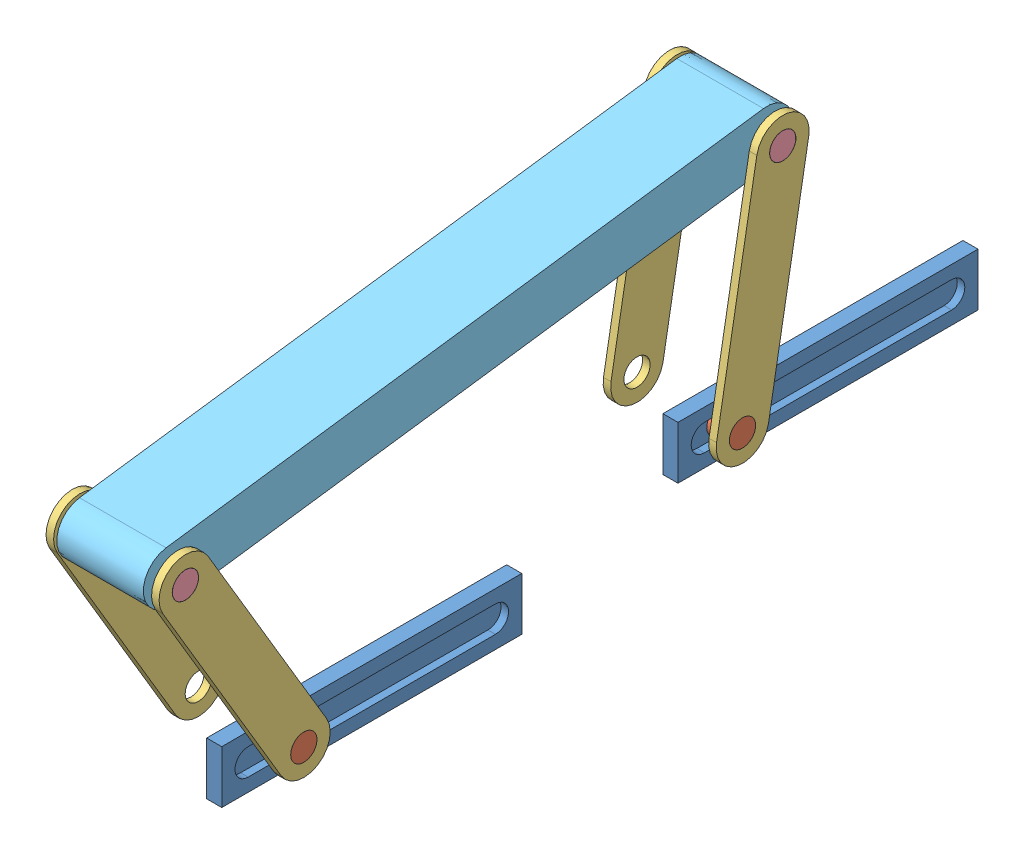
SolidWorks assembly EW - Convayer Assembly.SLDASM, configuration Default (file format 11000). Lengths in mm.
Overall size (150 461.83 1119.62).
11 component instances, 5 part files, 23 mates.
Components (placement in the parent):
- EW - Convayer Track (lower)-1: EW - Convayer Track (lower).SLDPRT [Default] at (74.9861 115.0955 407.3699) size (20 70 398.1)
- EW - Convayer Bolt (3.5 D x 3 L)-1: EW - Convayer Bolt (3.5 D x 3 L).SLDPRT [Default] at (114.9861 150.0955 318.4466) x (0 0.996066 0.088612) z (-1 0 0) size (35 35 30)
- EW - Convayer Arm (lower)-2: EW - Convayer Arm (lower).SLDPRT [Default] at (104.9861 414.9983 475.5788) x (1 0 0) z (0 0.860074 0.510169) size (10 70 378)
- EW - Convayer Shaft (3.5cm D x 15cm L)-1: EW - Convayer Shaft (3.5cm D x 15cm L).SLDPRT [Default] at (-35.0139 414.9983 475.5788) x (1 0 0) z (0 0.75541 -0.655253) size (150 35 35)
- EW - Convayer rep (11.5cm W x 80cm L - 3.5cm D)-1: EW - Convayer rep (11.5cm W x 80cm L - 3.5cm D).SLDPRT [Default] at (-20.8582 414.9983 475.5788) x (1 0 0) z (0 -0.135539 0.990772) size (115 70 870)
- EW - Convayer Arm (lower)-3: EW - Convayer Arm (lower).SLDPRT [Default] at (-35.0139 414.9983 475.5788) x (1 0 0) z (0 0.860074 0.510169) size (10 70 378)
- EW - Convayer Shaft (3.5cm D x 15cm L)-2: EW - Convayer Shaft (3.5cm D x 15cm L).SLDPRT [Default] at (-35.0139 523.4297 -317.0388) x (1 0 0) z (0 0.892337 0.451369) size (150 35 35)
- EW - Convayer Track (lower)-2: EW - Convayer Track (lower).SLDPRT [Default] at (74.9861 185.0955 -197.9819) size (20 70 398.1)
- EW - Convayer Arm (lower)-4: EW - Convayer Arm (lower).SLDPRT [Default] at (104.9861 523.4297 -317.0388) x (1 0 0) z (0 0.984851 -0.173402) size (10 70 378)
- EW - Convayer Arm (lower)-5: EW - Convayer Arm (lower).SLDPRT [Default] at (-35.0139 523.4297 -317.0388) x (1 0 0) z (0 0.984851 -0.173402) size (10 70 378)
- EW - Convayer Bolt (3.5 D x 3 L)-2: EW - Convayer Bolt (3.5 D x 3 L).SLDPRT [Default] at (114.9861 220.0955 -263.6309) x (0 -0.963954 -0.26607) z (-1 0 0) size (35 35 30)
Mates (geometry in assembly coordinates):
- Coincident1: coincident: plane of EW - Convayer Track (lower)-1 through (84.9861 150.0955 372.3699) normal (1 0 0); plane of EW - Convayer Bolt (3.5 D x 3 L)-1 through (84.9861 150.0955 318.4466) normal (-1 0 0)
- Tangent2: tangent: plane of EW - Convayer Track (lower)-1 through (84.9861 132.5955 372.3699) normal (0 1 0); cylinder of EW - Convayer Bolt (3.5 D x 3 L)-1 through (84.9861 150.0955 318.4466) axis (1 0 0) radius 17.5
- Concentric1: concentric: cylinder of EW - Convayer Bolt (3.5 D x 3 L)-1 through (84.9861 150.0955 318.4466) axis (1 0 0) radius 17.5; cylinder of EW - Convayer Arm (lower)-2 through (114.9861 150.0955 318.4466) axis (-1 0 0) radius 17.5
- Coincident2: coincident: plane of EW - Convayer Bolt (3.5 D x 3 L)-1 through (114.9861 150.0955 318.4466) normal (1 0 0); plane of EW - Convayer Arm (lower)-2 through (114.9861 150.0955 318.4466) normal (1 0 0)
- Concentric2: concentric: cylinder of EW - Convayer Arm (lower)-2 through (114.9861 414.9983 475.5788) axis (-1 0 0) radius 17.5; cylinder of EW - Convayer Shaft (3.5cm D x 15cm L)-1 through (114.9861 414.9983 475.5788) axis (-1 0 0) radius 17.5
- Coincident3: coincident: plane of EW - Convayer Arm (lower)-2 through (114.9861 150.0955 318.4466) normal (1 0 0); plane of EW - Convayer Shaft (3.5cm D x 15cm L)-1 through (114.9861 414.9983 475.5788) normal (1 0 0)
- Concentric3: concentric: cylinder of EW - Convayer Shaft (3.5cm D x 15cm L)-1 through (114.9861 414.9983 475.5788) axis (-1 0 0) radius 17.5; cylinder of EW - Convayer rep (11.5cm W x 80cm L - 3.5cm D)-1 through (94.1418 414.9983 475.5788) axis (-1 0 0) radius 17.5
- Concentric4: concentric: cylinder of EW - Convayer Shaft (3.5cm D x 15cm L)-1 through (114.9861 414.9983 475.5788) axis (-1 0 0) radius 17.5; cylinder of EW - Convayer Arm (lower)-3 through (-25.0139 414.9983 475.5788) axis (-1 0 0) radius 17.5
- Coincident4: coincident: plane of EW - Convayer Shaft (3.5cm D x 15cm L)-1 through (-35.0139 414.9983 475.5788) normal (-1 0 0); plane of EW - Convayer Arm (lower)-3 through (-35.0139 150.0955 318.4466) normal (-1 0 0)
- Concentric5: concentric: circle of EW - Convayer Arm (lower)-2; circle of EW - Convayer Arm (lower)-3
- Coincident5: coincident: cylinder of EW - Convayer rep (11.5cm W x 80cm L - 3.5cm D)-1 through (94.1418 523.4297 -317.0388) axis (-1 0 0) radius 17.5; circle of EW - Convayer Shaft (3.5cm D x 15cm L)-2
- Concentric6: concentric: cylinder of EW - Convayer Shaft (3.5cm D x 15cm L)-2 through (114.9861 523.4297 -317.0388) axis (-1 0 0) radius 17.5; cylinder of EW - Convayer Arm (lower)-4 through (114.9861 523.4297 -317.0388) axis (-1 0 0) radius 17.5
- Coincident10: coincident: plane of EW - Convayer Shaft (3.5cm D x 15cm L)-2 through (114.9861 523.4297 -317.0388) normal (1 0 0); plane of EW - Convayer Arm (lower)-4 through (114.9861 220.0955 -263.6309) normal (1 0 0)
- Coincident11: coincident: circle of EW - Convayer Arm (lower)-4; cylinder of EW - Convayer Bolt (3.5 D x 3 L)-2 through (84.9861 220.0955 -263.6309) axis (1 0 0) radius 17.5
- Coincident12: coincident: plane of EW - Convayer Arm (lower)-4 through (114.9861 220.0955 -263.6309) normal (1 0 0); plane of EW - Convayer Bolt (3.5 D x 3 L)-2 through (114.9861 220.0955 -263.6309) normal (1 0 0)
- Concentric7: concentric: cylinder of EW - Convayer Shaft (3.5cm D x 15cm L)-2 through (114.9861 523.4297 -317.0388) axis (-1 0 0) radius 17.5; cylinder of EW - Convayer Arm (lower)-5 through (-25.0139 523.4297 -317.0388) axis (-1 0 0) radius 17.5
- Coincident13: coincident: plane of EW - Convayer Shaft (3.5cm D x 15cm L)-2 through (-35.0139 523.4297 -317.0388) normal (-1 0 0); plane of EW - Convayer Arm (lower)-5 through (-35.0139 220.0955 -263.6309) normal (-1 0 0)
- Concentric8: concentric: circle of EW - Convayer Arm (lower)-4; circle of EW - Convayer Arm (lower)-5
- Parallel1: parallel: plane of EW - Convayer Arm (lower)-2 through (114.9861 150.0955 318.4466) normal (1 0 0); plane of EW - Convayer Arm (lower)-4 through (114.9861 220.0955 -263.6309) normal (1 0 0)
- Coincident17: coincident: plane of EW - Convayer Arm (lower)-2 through (114.9861 150.0955 318.4466) normal (1 0 0); plane of EW - Convayer Arm (lower)-4 through (114.9861 220.0955 -263.6309) normal (1 0 0)
- Coincident21: coincident: plane of EW - Convayer Track (lower)-2 through (84.9861 220.0955 -232.9819) normal (1 0 0); plane of EW - Convayer Bolt (3.5 D x 3 L)-2 through (84.9861 220.0955 -263.6309) normal (-1 0 0)
- Tangent4: tangent: plane of EW - Convayer Track (lower)-2 through (84.9861 202.5955 -232.9819) normal (0 1 0); cylinder of EW - Convayer Bolt (3.5 D x 3 L)-2 through (84.9861 220.0955 -263.6309) axis (1 0 0) radius 17.5
- Coincident23: coincident: line of EW - Convayer Track (lower)-1 through (94.9861 185.0955 9.2694) axis (0 0 1); plane of EW - Convayer Track (lower)-2 through (94.9861 185.0955 -197.9819) normal (0 -1 0)
